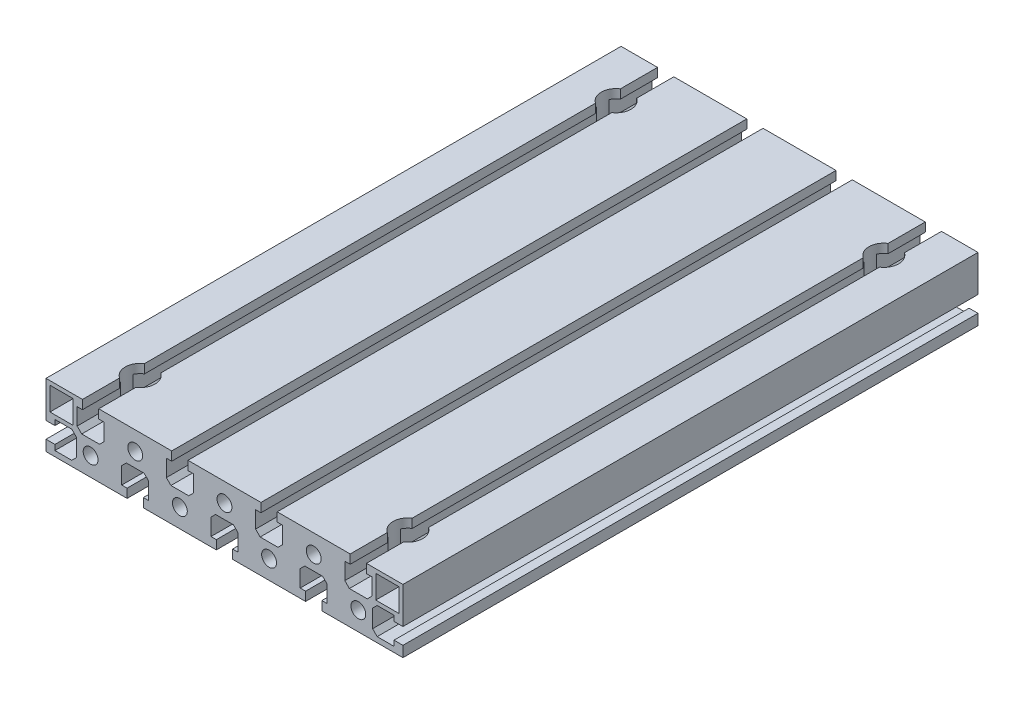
from build123d import *

# Parameters (mm, degrees)
EXTRUDE1_DEPTH      = 145
EXTRUDE1_DEPTH_BACK = 145
SKETCH1_R           = 3.75
SKETCH1_W           = 11.699951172
SKETCH1_H           = 11.700012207
SKETCH2_R           = 7.5
EXTRUDE2_DEPTH      = 174.634673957


with BuildPart() as part:
    # Sketch1 → Extrude1 (new, two sides: drawn at the far end of the back side and taken through both)
    with BuildSketch(Plane.XY.offset(-EXTRUDE1_DEPTH_BACK)):
        Polygon((-74.3, 18), (-71.6, 18), (-71.6, 22.5), (-90, 22.5), (-90, 4.1), (-85.5, 4.1), (-85.5, 6.8), (-77, 6.8), (-74.7, 4.5), (-74.7, -4.5), (-77, -6.8), (-85.5, -6.8), (-85.5, -4.1), (-90, -4.1), (-90, -9.5), (-49.1, -9.5), (-49.1, -5), (-51.8, -5), (-51.8, 3.5), (-49.5, 5.8), (-40.5, 5.8), (-38.2, 3.5), (-38.2, -5), (-40.9, -5), (-40.9, -9.5), (-4.1, -9.5), (-4.1, -5), (-6.8, -5), (-6.8, 3.5), (-4.5, 5.8), (4.5, 5.8), (6.8, 3.5), (6.8, -5), (4.1, -5), (4.1, -9.5), (40.9, -9.5), (40.9, -5), (38.2, -5), (38.2, 3.5), (40.5, 5.8), (49.5, 5.8), (51.8, 3.5), (51.8, -5), (49.1, -5), (49.1, -9.5), (90, -9.5), (90, -4.1), (85.5, -4.1), (85.5, -6.8), (77, -6.8), (74.7, -4.5), (74.7, 4.5), (77, 6.8), (85.5, 6.8), (85.5, 4.1), (90, 4.1), (90, 22.5), (71.6, 22.5), (71.6, 18), (74.3, 18), (74.3, 9.5), (72, 7.2), (63, 7.2), (60.7, 9.5), (60.7, 18), (63.4, 18), (63.4, 22.5), (26.6, 22.5), (26.6, 18), (29.3, 18), (29.3, 9.5), (27, 7.2), (18, 7.2), (15.7, 9.5), (15.7, 18), (18.4, 18), (18.4, 22.5), (-18.4, 22.5), (-18.4, 18), (-15.7, 18), (-15.7, 9.5), (-18, 7.2), (-27, 7.2), (-29.3, 9.5), (-29.3, 18), (-26.6, 18), (-26.6, 22.5), (-63.4, 22.5), (-63.4, 18), (-60.7, 18), (-60.7, 9.5), (-63, 7.2), (-72, 7.2), (-74.3, 9.5), align=None)
        with Locations((67.5, 0)):
            Circle(SKETCH1_R, mode=Mode.SUBTRACT)
        with Locations((45, 13)):
            Circle(SKETCH1_R, mode=Mode.SUBTRACT)
        with Locations((22.5, 0)):
            Circle(SKETCH1_R, mode=Mode.SUBTRACT)
        with Locations((0, 13)):
            Circle(SKETCH1_R, mode=Mode.SUBTRACT)
        with Locations((-22.5, 0)):
            Circle(SKETCH1_R, mode=Mode.SUBTRACT)
        with Locations((-45, 13)):
            Circle(SKETCH1_R, mode=Mode.SUBTRACT)
        with Locations((-67.5, 0)):
            Circle(SKETCH1_R, mode=Mode.SUBTRACT)
        with Locations((82.149975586, 14.649993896)):
            Rectangle(SKETCH1_W, SKETCH1_H, mode=Mode.SUBTRACT)
        with Locations((-82.150024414, 14.649993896)):
            Rectangle(SKETCH1_W, SKETCH1_H, mode=Mode.SUBTRACT)
    extrude(amount=EXTRUDE1_DEPTH + EXTRUDE1_DEPTH_BACK)

    # Sketch2 → Extrude2 (cut, through all)
    with BuildSketch(Plane(origin=(0, 22.5, 0), x_dir=(1, 0, 0), z_dir=(0, 1, 0))):
        with Locations(Location((-67.5, 120, 0), (0, 0, 270))):
            Circle(SKETCH2_R)
        with Locations(Location((67.5, 120, 0), (0, 0, 270))):
            Circle(SKETCH2_R)
        with Locations(Location((-67.5, -120, 0), (0, 0, 270))):
            Circle(SKETCH2_R)
        with Locations(Location((67.5, -120, 0), (0, 0, 270))):
            Circle(SKETCH2_R)
    extrude(amount=-EXTRUDE2_DEPTH, mode=Mode.SUBTRACT)


solid = part.part
